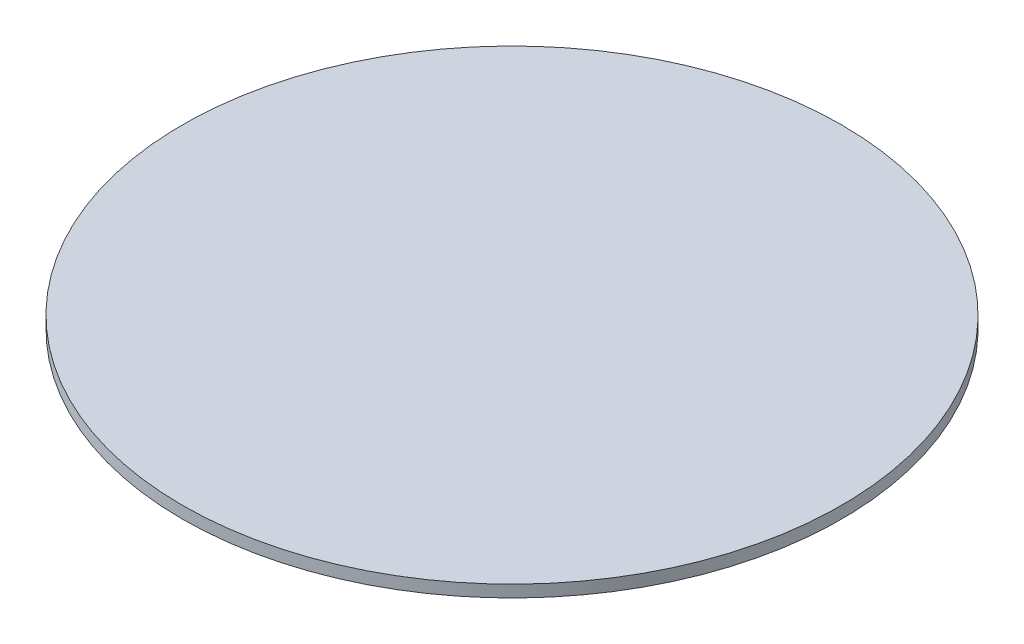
from build123d import *


with BuildPart() as part:
    # Sketch1 → Revolve1 (revolve)
    with BuildSketch(Plane.XY, mode=Mode.PRIVATE) as revolve1_sk:
        Polygon((0, 0), (257.175, 0), (257.175, -4.7625), (261.9375, -4.7625), (261.9375, 4.7625), (0, 4.7625), align=None)
    revolve(revolve1_sk.sketch.rotate(Axis((0, 4.7625, 0), (0, -1, 0)), 90), axis=Axis((0, 4.7625, 0), (0, -1, 0)))


solid = part.part
